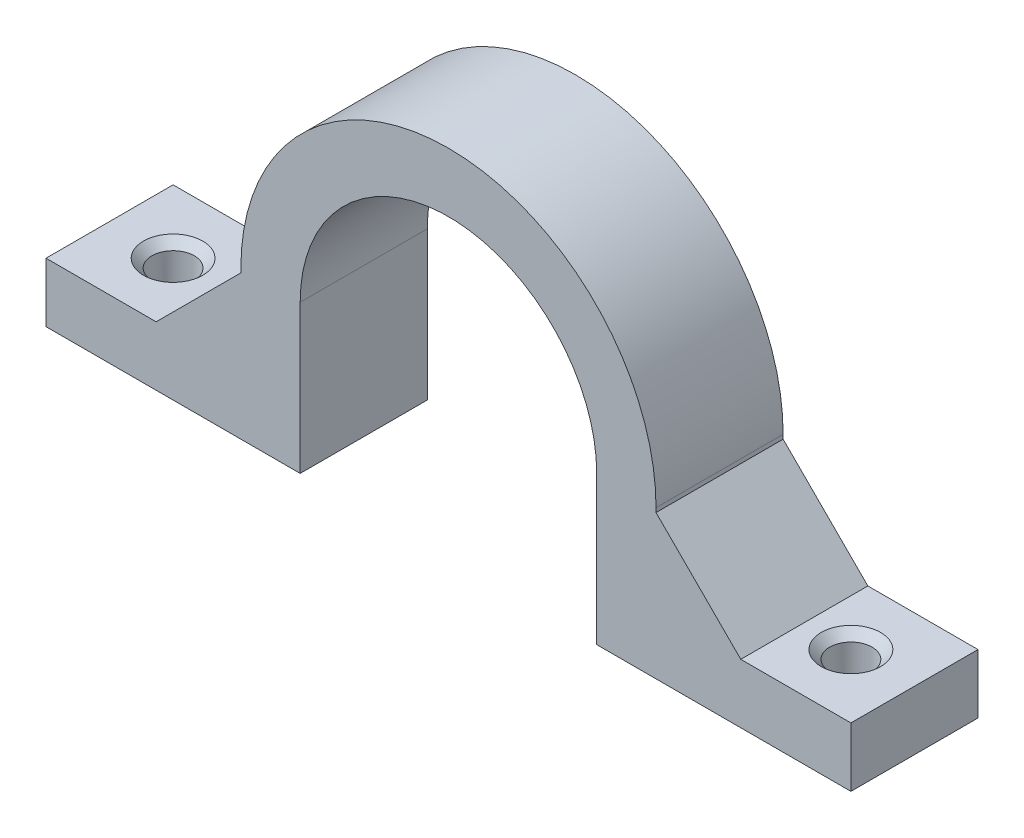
from build123d import *

# Parameters (mm, degrees)
BOSS_EXTRU_1_DEPTH      = 15
CHANFREIN1_SIZE         = 10
ESQUISSE2_R             = 2.5
ENL_V_MAT_EXTRU_1_DEPTH = 15
CHANFREIN2_SIZE         = 1


with BuildPart() as part:
    # Esquisse1 → Boss.-Extru.1 (new body)
    with BuildSketch(Plane.XY):
        with BuildLine():
            Line((0, 0), (30, 0))
            Line((30, 0), (30, 17.5))
            ThreePointArc((30, 17.5), (47.5, 35), (65, 17.5))
            Line((65, 17.5), (65, 0))
            Line((65, 0), (95, 0))
            Line((95, 0), (95, 7))
            Line((95, 7), (72, 7))
            Line((72, 7), (72, 17.5))
            ThreePointArc((72, 17.5), (47.5, 42), (23, 17.5))
            Line((23, 17.5), (23, 7))
            Line((23, 7), (0, 7))
            Line((0, 7), (0, 0))
        make_face()
    extrude(amount=BOSS_EXTRU_1_DEPTH)

    # Chanfrein1
    chanfrein1_edges = [part.edges().sort_by_distance(p)[0] for p in [
        (23, 7, 7.5),
        (72, 7, 7.5),
    ]]
    chamfer(chanfrein1_edges, length=CHANFREIN1_SIZE)

    # Esquisse2 → Enl_v. mat.-Extru.1 (cut)
    with BuildSketch(Plane(origin=(0, 7, 0), x_dir=(1, 0, 0), z_dir=(0, 1, 0))):
        with Locations(Location((87.5, -7.5, 0), (0, 0, 270))):
            Circle(ESQUISSE2_R)
        with Locations(Location((7.5, -7.5, 0), (0, 0, 270))):
            Circle(ESQUISSE2_R)
    extrude(amount=-ENL_V_MAT_EXTRU_1_DEPTH, mode=Mode.SUBTRACT)

    # Chanfrein2
    chanfrein2_edges = [part.edges().sort_by_distance(p)[0] for p in [
        (87.5, 7, 5),
        (7.5, 7, 5),
    ]]
    chamfer(chanfrein2_edges, length=CHANFREIN2_SIZE)


solid = part.part
